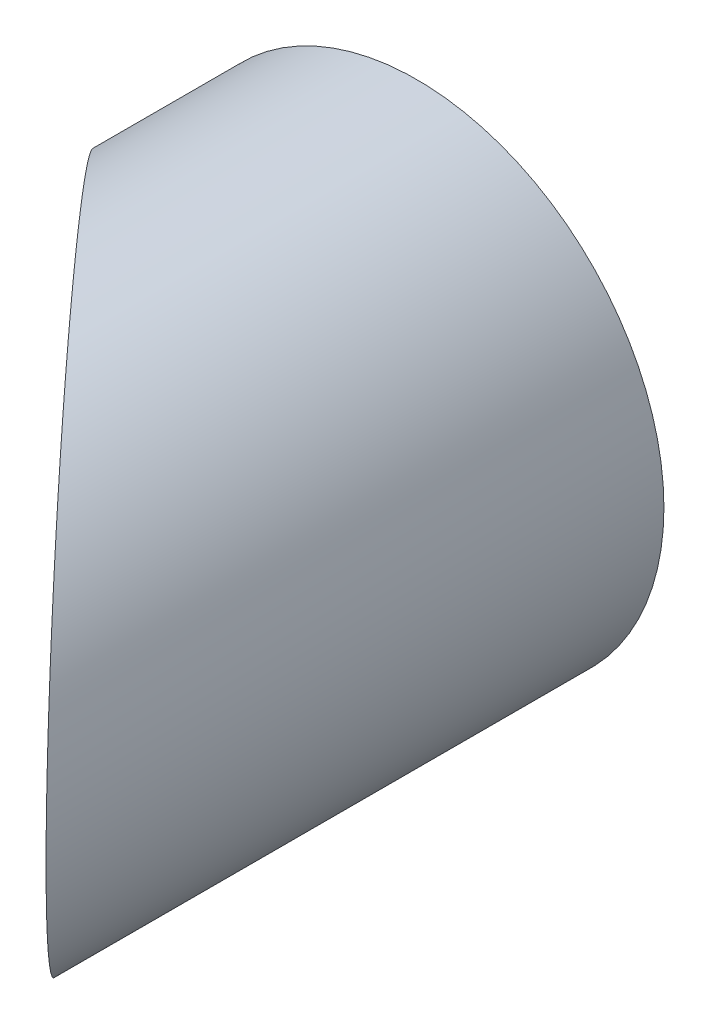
ISO-10303-21;
HEADER;
FILE_DESCRIPTION(('STEP AP214'),'2;1');
FILE_NAME('part.step','',(''),(''),'','','');
FILE_SCHEMA(('AUTOMOTIVE_DESIGN { 1 0 10303 214 1 1 1 1 }'));
ENDSEC;
DATA;
#1=APPLICATION_CONTEXT('core data for automotive mechanical design processes');
#2=APPLICATION_PROTOCOL_DEFINITION('international standard','automotive_design',2000,#1);
#3=PRODUCT_CONTEXT('',#1,'mechanical');
#4=PRODUCT('Part','Part','',(#3));
#5=PRODUCT_RELATED_PRODUCT_CATEGORY('part','',(#4));
#6=PRODUCT_DEFINITION_FORMATION('','',#4);
#7=PRODUCT_DEFINITION_CONTEXT('part definition',#1,'design');
#8=PRODUCT_DEFINITION('design','',#6,#7);
#9=PRODUCT_DEFINITION_SHAPE('','',#8);
#10=(LENGTH_UNIT() NAMED_UNIT(*) SI_UNIT(.MILLI.,.METRE.));
#11=(NAMED_UNIT(*) PLANE_ANGLE_UNIT() SI_UNIT($,.RADIAN.));
#12=(NAMED_UNIT(*) SI_UNIT($,.STERADIAN.) SOLID_ANGLE_UNIT());
#13=UNCERTAINTY_MEASURE_WITH_UNIT(LENGTH_MEASURE(1.E-05),#10,'distance_accuracy_value','');
#14=(GEOMETRIC_REPRESENTATION_CONTEXT(3) GLOBAL_UNCERTAINTY_ASSIGNED_CONTEXT((#13)) GLOBAL_UNIT_ASSIGNED_CONTEXT((#10,
#11,#12)) REPRESENTATION_CONTEXT('',''));
#15=CARTESIAN_POINT('',(0.,0.,0.));
#16=DIRECTION('',(0.,0.,1.));
#17=DIRECTION('',(1.,0.,0.));
#18=AXIS2_PLACEMENT_3D('',#15,#16,#17);
#19=CARTESIAN_POINT('',(0.,0.,0.));
#20=DIRECTION('',(0.,0.,1.));
#21=DIRECTION('',(1.,0.,0.));
#22=AXIS2_PLACEMENT_3D('',#19,#20,#21);
#23=PLANE('',#22);
#24=CARTESIAN_POINT('',(0.,0.,0.));
#25=DIRECTION('',(0.,0.,1.));
#26=DIRECTION('',(1.,0.,0.));
#27=AXIS2_PLACEMENT_3D('',#24,#25,#26);
#28=CIRCLE('',#27,9.525);
#29=CARTESIAN_POINT('',(9.525,0.,0.));
#30=VERTEX_POINT('',#29);
#31=EDGE_CURVE('E10',#30,#30,#28,.T.);
#32=ORIENTED_EDGE('',*,*,#31,.F.);
#33=EDGE_LOOP('',(#32));
#34=FACE_BOUND('',#33,.T.);
#35=CARTESIAN_POINT('',(0.,0.,0.));
#36=DIRECTION('',(0.,0.,1.));
#37=DIRECTION('',(1.,0.,0.));
#38=AXIS2_PLACEMENT_3D('',#35,#36,#37);
#39=CIRCLE('',#38,3.9878);
#40=CARTESIAN_POINT('',(3.9878,0.,0.));
#41=VERTEX_POINT('',#40);
#42=EDGE_CURVE('E41',#41,#41,#39,.T.);
#43=ORIENTED_EDGE('',*,*,#42,.T.);
#44=EDGE_LOOP('',(#43));
#45=FACE_BOUND('',#44,.T.);
#46=ADVANCED_FACE('F33',(#34,#45),#23,.F.);
#47=CARTESIAN_POINT('',(0.,0.,23.8125));
#48=DIRECTION('',(0.,0.,-1.));
#49=DIRECTION('',(-1.,0.,0.));
#50=AXIS2_PLACEMENT_3D('',#47,#48,#49);
#51=CYLINDRICAL_SURFACE('',#50,9.525);
#52=CARTESIAN_POINT('',(0.,0.,13.2339157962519));
#53=DIRECTION('',(0.743144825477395,0.,-0.669130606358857));
#54=DIRECTION('',(-0.669130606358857,0.,-0.743144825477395));
#55=AXIS2_PLACEMENT_3D('',#52,#53,#54);
#56=ELLIPSE('',#55,14.2348891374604,9.525);
#57=CARTESIAN_POINT('',(-9.525,0.,2.65533159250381));
#58=VERTEX_POINT('',#57);
#59=EDGE_CURVE('E45',#58,#58,#56,.T.);
#60=ORIENTED_EDGE('',*,*,#59,.T.);
#61=EDGE_LOOP('',(#60));
#62=FACE_BOUND('',#61,.T.);
#63=ORIENTED_EDGE('',*,*,#31,.T.);
#64=EDGE_LOOP('',(#63));
#65=FACE_BOUND('',#64,.T.);
#66=ADVANCED_FACE('F35',(#62,#65),#51,.T.);
#67=CARTESIAN_POINT('',(0.,0.,23.8125));
#68=DIRECTION('',(0.,0.,-1.));
#69=DIRECTION('',(-1.,0.,0.));
#70=AXIS2_PLACEMENT_3D('',#67,#68,#69);
#71=CYLINDRICAL_SURFACE('',#70,3.9878);
#72=CARTESIAN_POINT('',(0.,0.,13.2339157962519));
#73=DIRECTION('',(0.743144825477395,0.,-0.669130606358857));
#74=DIRECTION('',(-0.669130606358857,0.,-0.743144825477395));
#75=AXIS2_PLACEMENT_3D('',#72,#73,#74);
#76=ELLIPSE('',#75,5.9596735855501,3.9878);
#77=CARTESIAN_POINT('',(-3.9878,0.,8.80501520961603));
#78=VERTEX_POINT('',#77);
#79=EDGE_CURVE('E37',#78,#78,#76,.T.);
#80=ORIENTED_EDGE('',*,*,#79,.F.);
#81=EDGE_LOOP('',(#80));
#82=FACE_BOUND('',#81,.T.);
#83=ORIENTED_EDGE('',*,*,#42,.F.);
#84=EDGE_LOOP('',(#83));
#85=FACE_BOUND('',#84,.T.);
#86=ADVANCED_FACE('F57',(#82,#85),#71,.F.);
#87=CARTESIAN_POINT('',(9.525,-9.525,23.8125));
#88=DIRECTION('',(0.743144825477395,0.,-0.669130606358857));
#89=DIRECTION('',(-0.669130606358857,0.,-0.743144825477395));
#90=AXIS2_PLACEMENT_3D('',#87,#88,#89);
#91=PLANE('',#90);
#92=ORIENTED_EDGE('',*,*,#79,.T.);
#93=EDGE_LOOP('',(#92));
#94=FACE_BOUND('',#93,.T.);
#95=ORIENTED_EDGE('',*,*,#59,.F.);
#96=EDGE_LOOP('',(#95));
#97=FACE_BOUND('',#96,.T.);
#98=ADVANCED_FACE('F54',(#94,#97),#91,.F.);
#99=CLOSED_SHELL('',(#46,#66,#86,#98));
#100=MANIFOLD_SOLID_BREP('B2',#99);
#101=ADVANCED_BREP_SHAPE_REPRESENTATION('',(#18,#100),#14);
#102=SHAPE_DEFINITION_REPRESENTATION(#9,#101);
ENDSEC;
END-ISO-10303-21;
